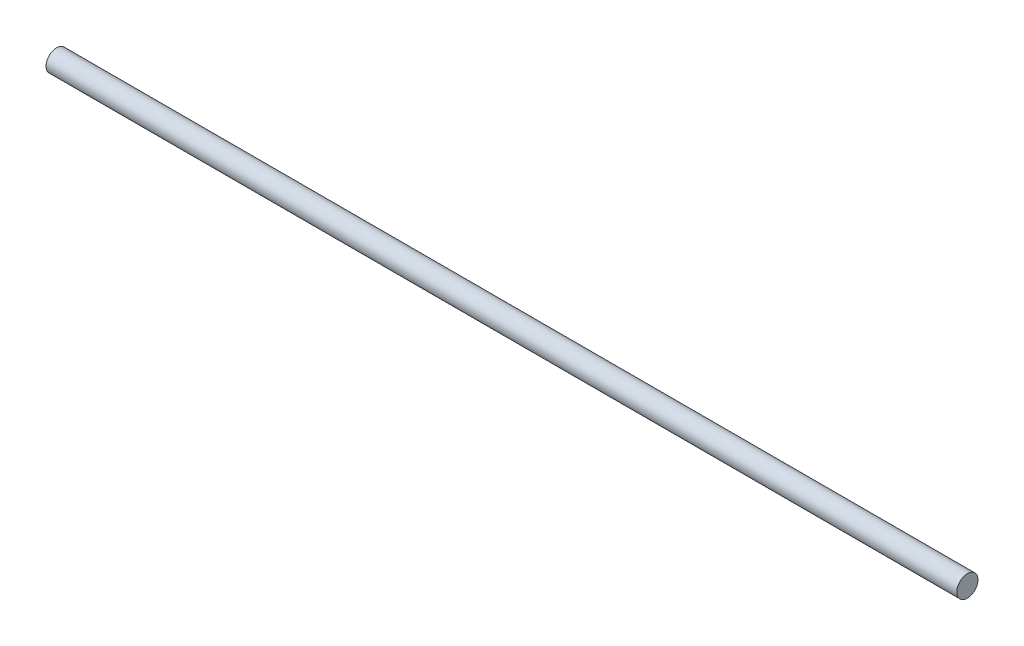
ISO-10303-21;
HEADER;
FILE_DESCRIPTION(('STEP AP214'),'2;1');
FILE_NAME('part.step','',(''),(''),'','','');
FILE_SCHEMA(('AUTOMOTIVE_DESIGN { 1 0 10303 214 1 1 1 1 }'));
ENDSEC;
DATA;
#1=APPLICATION_CONTEXT('core data for automotive mechanical design processes');
#2=APPLICATION_PROTOCOL_DEFINITION('international standard','automotive_design',2000,#1);
#3=PRODUCT_CONTEXT('',#1,'mechanical');
#4=PRODUCT('Part','Part','',(#3));
#5=PRODUCT_RELATED_PRODUCT_CATEGORY('part','',(#4));
#6=PRODUCT_DEFINITION_FORMATION('','',#4);
#7=PRODUCT_DEFINITION_CONTEXT('part definition',#1,'design');
#8=PRODUCT_DEFINITION('design','',#6,#7);
#9=PRODUCT_DEFINITION_SHAPE('','',#8);
#10=(LENGTH_UNIT() NAMED_UNIT(*) SI_UNIT(.MILLI.,.METRE.));
#11=(NAMED_UNIT(*) PLANE_ANGLE_UNIT() SI_UNIT($,.RADIAN.));
#12=(NAMED_UNIT(*) SI_UNIT($,.STERADIAN.) SOLID_ANGLE_UNIT());
#13=UNCERTAINTY_MEASURE_WITH_UNIT(LENGTH_MEASURE(1.E-05),#10,'distance_accuracy_value','');
#14=(GEOMETRIC_REPRESENTATION_CONTEXT(3) GLOBAL_UNCERTAINTY_ASSIGNED_CONTEXT((#13)) GLOBAL_UNIT_ASSIGNED_CONTEXT((#10,
#11,#12)) REPRESENTATION_CONTEXT('',''));
#15=CARTESIAN_POINT('',(0.,0.,0.));
#16=DIRECTION('',(0.,0.,1.));
#17=DIRECTION('',(1.,0.,0.));
#18=AXIS2_PLACEMENT_3D('',#15,#16,#17);
#19=CARTESIAN_POINT('',(500.,0.,0.));
#20=DIRECTION('',(-1.,0.,0.));
#21=DIRECTION('',(0.,0.,0.999999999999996));
#22=AXIS2_PLACEMENT_3D('',#19,#20,#21);
#23=CYLINDRICAL_SURFACE('',#22,7.);
#24=CARTESIAN_POINT('',(500.,0.,0.));
#25=DIRECTION('',(1.,0.,0.));
#26=DIRECTION('',(0.,0.,-0.999999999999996));
#27=AXIS2_PLACEMENT_3D('',#24,#25,#26);
#28=CIRCLE('',#27,7.);
#29=CARTESIAN_POINT('',(500.,0.,6.99999999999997));
#30=VERTEX_POINT('',#29);
#31=EDGE_CURVE('E10',#30,#30,#28,.T.);
#32=CARTESIAN_POINT('',(-100.,0.,0.));
#33=DIRECTION('',(1.,0.,0.));
#34=DIRECTION('',(0.,0.,-0.999999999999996));
#35=AXIS2_PLACEMENT_3D('',#32,#33,#34);
#36=CIRCLE('',#35,7.);
#37=CARTESIAN_POINT('',(-100.,0.,6.99999999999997));
#38=VERTEX_POINT('',#37);
#39=EDGE_CURVE('E35',#38,#38,#36,.T.);
#40=CARTESIAN_POINT('',(500.,0.,6.99999999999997));
#41=CARTESIAN_POINT('',(493.75,0.,6.99999999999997));
#42=CARTESIAN_POINT('',(487.5,0.,6.99999999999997));
#43=CARTESIAN_POINT('',(475.,0.,6.99999999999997));
#44=CARTESIAN_POINT('',(468.75,0.,6.99999999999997));
#45=CARTESIAN_POINT('',(456.25,0.,6.99999999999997));
#46=CARTESIAN_POINT('',(450.,0.,6.99999999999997));
#47=CARTESIAN_POINT('',(437.5,0.,6.99999999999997));
#48=CARTESIAN_POINT('',(431.25,0.,6.99999999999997));
#49=CARTESIAN_POINT('',(418.75,0.,6.99999999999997));
#50=CARTESIAN_POINT('',(412.5,0.,6.99999999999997));
#51=CARTESIAN_POINT('',(400.,0.,6.99999999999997));
#52=CARTESIAN_POINT('',(393.75,0.,6.99999999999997));
#53=CARTESIAN_POINT('',(381.25,0.,6.99999999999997));
#54=CARTESIAN_POINT('',(375.,0.,6.99999999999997));
#55=CARTESIAN_POINT('',(362.5,0.,6.99999999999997));
#56=CARTESIAN_POINT('',(356.25,0.,6.99999999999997));
#57=CARTESIAN_POINT('',(343.75,0.,6.99999999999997));
#58=CARTESIAN_POINT('',(337.5,0.,6.99999999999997));
#59=CARTESIAN_POINT('',(325.,0.,6.99999999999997));
#60=CARTESIAN_POINT('',(318.75,0.,6.99999999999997));
#61=CARTESIAN_POINT('',(306.25,0.,6.99999999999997));
#62=CARTESIAN_POINT('',(300.,0.,6.99999999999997));
#63=CARTESIAN_POINT('',(287.5,0.,6.99999999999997));
#64=CARTESIAN_POINT('',(281.25,0.,6.99999999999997));
#65=CARTESIAN_POINT('',(268.75,0.,6.99999999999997));
#66=CARTESIAN_POINT('',(262.5,0.,6.99999999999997));
#67=CARTESIAN_POINT('',(250.,0.,6.99999999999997));
#68=CARTESIAN_POINT('',(243.75,0.,6.99999999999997));
#69=CARTESIAN_POINT('',(231.25,0.,6.99999999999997));
#70=CARTESIAN_POINT('',(225.,0.,6.99999999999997));
#71=CARTESIAN_POINT('',(212.5,0.,6.99999999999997));
#72=CARTESIAN_POINT('',(206.25,0.,6.99999999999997));
#73=CARTESIAN_POINT('',(193.75,0.,6.99999999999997));
#74=CARTESIAN_POINT('',(187.5,0.,6.99999999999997));
#75=CARTESIAN_POINT('',(175.,0.,6.99999999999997));
#76=CARTESIAN_POINT('',(168.75,0.,6.99999999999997));
#77=CARTESIAN_POINT('',(156.25,0.,6.99999999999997));
#78=CARTESIAN_POINT('',(150.,0.,6.99999999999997));
#79=CARTESIAN_POINT('',(137.5,0.,6.99999999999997));
#80=CARTESIAN_POINT('',(131.25,0.,6.99999999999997));
#81=CARTESIAN_POINT('',(118.75,0.,6.99999999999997));
#82=CARTESIAN_POINT('',(112.5,0.,6.99999999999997));
#83=CARTESIAN_POINT('',(100.,0.,6.99999999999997));
#84=CARTESIAN_POINT('',(93.75,0.,6.99999999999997));
#85=CARTESIAN_POINT('',(81.25,0.,6.99999999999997));
#86=CARTESIAN_POINT('',(75.,0.,6.99999999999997));
#87=CARTESIAN_POINT('',(62.5,0.,6.99999999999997));
#88=CARTESIAN_POINT('',(56.25,0.,6.99999999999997));
#89=CARTESIAN_POINT('',(43.75,0.,6.99999999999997));
#90=CARTESIAN_POINT('',(37.5,0.,6.99999999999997));
#91=CARTESIAN_POINT('',(25.,0.,6.99999999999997));
#92=CARTESIAN_POINT('',(18.75,0.,6.99999999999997));
#93=CARTESIAN_POINT('',(6.25000000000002,0.,6.99999999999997));
#94=CARTESIAN_POINT('',(0.,0.,6.99999999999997));
#95=CARTESIAN_POINT('',(-12.5,0.,6.99999999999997));
#96=CARTESIAN_POINT('',(-18.75,0.,6.99999999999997));
#97=CARTESIAN_POINT('',(-31.25,0.,6.99999999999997));
#98=CARTESIAN_POINT('',(-37.5,0.,6.99999999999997));
#99=CARTESIAN_POINT('',(-50.,0.,6.99999999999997));
#100=CARTESIAN_POINT('',(-56.25,0.,6.99999999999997));
#101=CARTESIAN_POINT('',(-68.75,0.,6.99999999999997));
#102=CARTESIAN_POINT('',(-75.,0.,6.99999999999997));
#103=CARTESIAN_POINT('',(-87.5,0.,6.99999999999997));
#104=CARTESIAN_POINT('',(-93.75,0.,6.99999999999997));
#105=CARTESIAN_POINT('',(-100.,0.,6.99999999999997));
#106=B_SPLINE_CURVE_WITH_KNOTS('',3,(#40,#41,#42,#43,#44,#45,#46,#47,#48,#49,#50,#51,#52,#53,
#54,#55,#56,#57,#58,#59,#60,#61,#62,#63,#64,#65,#66,#67,#68,#69,#70,#71,#72,#73,#74,#75,#76,#77,
#78,#79,#80,#81,#82,#83,#84,#85,#86,#87,#88,#89,#90,#91,#92,#93,#94,#95,#96,#97,#98,#99,#100,
#101,#102,#103,#104,#105),.UNSPECIFIED.,.F.,.F.,(4,2,2,2,2,2,2,2,2,2,2,2,2,2,2,2,2,2,2,2,2,2,2,
2,2,2,2,2,2,2,2,2,4),(0.,18.75,37.5,56.25,75.,93.7499999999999,112.5,131.25,150.,168.75,187.5,
206.25,225.,243.75,262.5,281.25,300.,318.75,337.5,356.25,375.,393.75,412.5,431.25,450.,468.75,
487.5,506.25,525.,543.75,562.5,581.25,600.),.UNSPECIFIED.);
#107=EDGE_CURVE('BSEAM29',#30,#38,#106,.T.);
#108=ORIENTED_EDGE('',*,*,#31,.F.);
#109=ORIENTED_EDGE('',*,*,#39,.T.);
#110=ORIENTED_EDGE('',*,*,#107,.T.);
#111=ORIENTED_EDGE('',*,*,#107,.F.);
#112=EDGE_LOOP('',(#108,#110,#109,#111));
#113=FACE_BOUND('',#112,.T.);
#114=ADVANCED_FACE('F29',(#113),#23,.T.);
#115=CARTESIAN_POINT('',(500.,0.,0.));
#116=DIRECTION('',(1.,0.,0.));
#117=DIRECTION('',(0.,0.,-0.999999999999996));
#118=AXIS2_PLACEMENT_3D('',#115,#116,#117);
#119=PLANE('',#118);
#120=ORIENTED_EDGE('',*,*,#31,.T.);
#121=EDGE_LOOP('',(#120));
#122=FACE_BOUND('',#121,.T.);
#123=ADVANCED_FACE('F44',(#122),#119,.T.);
#124=CARTESIAN_POINT('',(-100.,0.,0.));
#125=DIRECTION('',(1.,0.,0.));
#126=DIRECTION('',(0.,0.,-0.999999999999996));
#127=AXIS2_PLACEMENT_3D('',#124,#125,#126);
#128=PLANE('',#127);
#129=ORIENTED_EDGE('',*,*,#39,.F.);
#130=EDGE_LOOP('',(#129));
#131=FACE_BOUND('',#130,.T.);
#132=ADVANCED_FACE('F42',(#131),#128,.F.);
#133=CLOSED_SHELL('',(#114,#123,#132));
#134=MANIFOLD_SOLID_BREP('B2',#133);
#135=ADVANCED_BREP_SHAPE_REPRESENTATION('',(#18,#134),#14);
#136=SHAPE_DEFINITION_REPRESENTATION(#9,#135);
ENDSEC;
END-ISO-10303-21;
